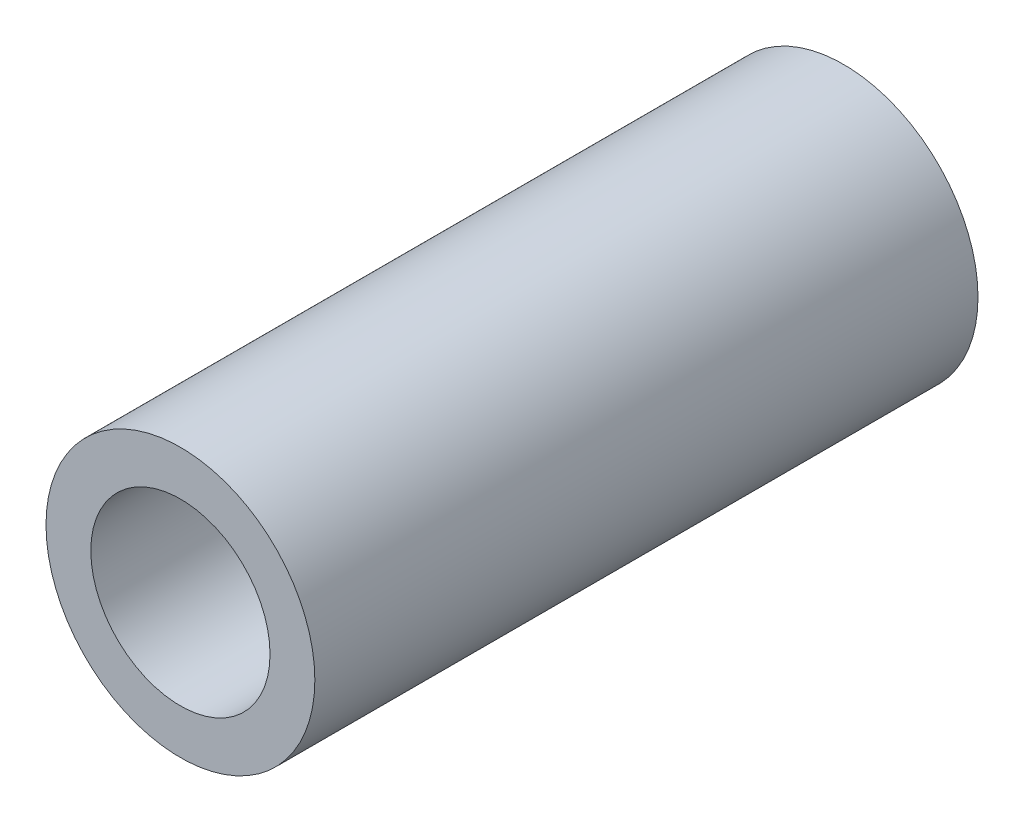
ISO-10303-21;
HEADER;
FILE_DESCRIPTION(('STEP AP214'),'2;1');
FILE_NAME('part.step','',(''),(''),'','','');
FILE_SCHEMA(('AUTOMOTIVE_DESIGN { 1 0 10303 214 1 1 1 1 }'));
ENDSEC;
DATA;
#1=APPLICATION_CONTEXT('core data for automotive mechanical design processes');
#2=APPLICATION_PROTOCOL_DEFINITION('international standard','automotive_design',2000,#1);
#3=PRODUCT_CONTEXT('',#1,'mechanical');
#4=PRODUCT('Part','Part','',(#3));
#5=PRODUCT_RELATED_PRODUCT_CATEGORY('part','',(#4));
#6=PRODUCT_DEFINITION_FORMATION('','',#4);
#7=PRODUCT_DEFINITION_CONTEXT('part definition',#1,'design');
#8=PRODUCT_DEFINITION('design','',#6,#7);
#9=PRODUCT_DEFINITION_SHAPE('','',#8);
#10=(LENGTH_UNIT() NAMED_UNIT(*) SI_UNIT(.MILLI.,.METRE.));
#11=(NAMED_UNIT(*) PLANE_ANGLE_UNIT() SI_UNIT($,.RADIAN.));
#12=(NAMED_UNIT(*) SI_UNIT($,.STERADIAN.) SOLID_ANGLE_UNIT());
#13=UNCERTAINTY_MEASURE_WITH_UNIT(LENGTH_MEASURE(1.E-05),#10,'distance_accuracy_value','');
#14=(GEOMETRIC_REPRESENTATION_CONTEXT(3) GLOBAL_UNCERTAINTY_ASSIGNED_CONTEXT((#13)) GLOBAL_UNIT_ASSIGNED_CONTEXT((#10,
#11,#12)) REPRESENTATION_CONTEXT('',''));
#15=CARTESIAN_POINT('',(0.,0.,0.));
#16=DIRECTION('',(0.,0.,1.));
#17=DIRECTION('',(1.,0.,0.));
#18=AXIS2_PLACEMENT_3D('',#15,#16,#17);
#19=CARTESIAN_POINT('',(0.,0.,14.8));
#20=DIRECTION('',(0.,0.,1.));
#21=DIRECTION('',(1.,0.,0.));
#22=AXIS2_PLACEMENT_3D('',#19,#20,#21);
#23=PLANE('',#22);
#24=CARTESIAN_POINT('',(0.,0.,14.8));
#25=DIRECTION('',(0.,0.,1.));
#26=DIRECTION('',(1.,0.,0.));
#27=AXIS2_PLACEMENT_3D('',#24,#25,#26);
#28=CIRCLE('',#27,3.);
#29=CARTESIAN_POINT('',(3.,0.,14.8));
#30=VERTEX_POINT('',#29);
#31=EDGE_CURVE('E10',#30,#30,#28,.T.);
#32=ORIENTED_EDGE('',*,*,#31,.T.);
#33=EDGE_LOOP('',(#32));
#34=FACE_BOUND('',#33,.T.);
#35=CARTESIAN_POINT('',(0.,0.,14.8));
#36=DIRECTION('',(0.,0.,1.));
#37=DIRECTION('',(1.,0.,0.));
#38=AXIS2_PLACEMENT_3D('',#35,#36,#37);
#39=CIRCLE('',#38,2.);
#40=CARTESIAN_POINT('',(2.,0.,14.8));
#41=VERTEX_POINT('',#40);
#42=EDGE_CURVE('E43',#41,#41,#39,.T.);
#43=ORIENTED_EDGE('',*,*,#42,.F.);
#44=EDGE_LOOP('',(#43));
#45=FACE_BOUND('',#44,.T.);
#46=ADVANCED_FACE('F32',(#34,#45),#23,.T.);
#47=CARTESIAN_POINT('',(0.,0.,0.));
#48=DIRECTION('',(0.,0.,1.));
#49=DIRECTION('',(1.,0.,0.));
#50=AXIS2_PLACEMENT_3D('',#47,#48,#49);
#51=PLANE('',#50);
#52=CARTESIAN_POINT('',(0.,0.,0.));
#53=DIRECTION('',(0.,0.,1.));
#54=DIRECTION('',(1.,0.,0.));
#55=AXIS2_PLACEMENT_3D('',#52,#53,#54);
#56=CIRCLE('',#55,3.);
#57=CARTESIAN_POINT('',(3.,0.,0.));
#58=VERTEX_POINT('',#57);
#59=EDGE_CURVE('E36',#58,#58,#56,.T.);
#60=ORIENTED_EDGE('',*,*,#59,.F.);
#61=EDGE_LOOP('',(#60));
#62=FACE_BOUND('',#61,.T.);
#63=CARTESIAN_POINT('',(0.,0.,0.));
#64=DIRECTION('',(0.,0.,1.));
#65=DIRECTION('',(1.,0.,0.));
#66=AXIS2_PLACEMENT_3D('',#63,#64,#65);
#67=CIRCLE('',#66,2.);
#68=CARTESIAN_POINT('',(2.,0.,0.));
#69=VERTEX_POINT('',#68);
#70=EDGE_CURVE('E45',#69,#69,#67,.T.);
#71=ORIENTED_EDGE('',*,*,#70,.T.);
#72=EDGE_LOOP('',(#71));
#73=FACE_BOUND('',#72,.T.);
#74=ADVANCED_FACE('F55',(#62,#73),#51,.F.);
#75=CARTESIAN_POINT('',(0.,0.,14.8));
#76=DIRECTION('',(0.,0.,-1.));
#77=DIRECTION('',(-1.,0.,0.));
#78=AXIS2_PLACEMENT_3D('',#75,#76,#77);
#79=CYLINDRICAL_SURFACE('',#78,3.);
#80=ORIENTED_EDGE('',*,*,#31,.F.);
#81=EDGE_LOOP('',(#80));
#82=FACE_BOUND('',#81,.T.);
#83=ORIENTED_EDGE('',*,*,#59,.T.);
#84=EDGE_LOOP('',(#83));
#85=FACE_BOUND('',#84,.T.);
#86=ADVANCED_FACE('F34',(#82,#85),#79,.T.);
#87=CARTESIAN_POINT('',(0.,0.,14.8));
#88=DIRECTION('',(0.,0.,-1.));
#89=DIRECTION('',(-1.,0.,0.));
#90=AXIS2_PLACEMENT_3D('',#87,#88,#89);
#91=CYLINDRICAL_SURFACE('',#90,2.);
#92=ORIENTED_EDGE('',*,*,#42,.T.);
#93=EDGE_LOOP('',(#92));
#94=FACE_BOUND('',#93,.T.);
#95=ORIENTED_EDGE('',*,*,#70,.F.);
#96=EDGE_LOOP('',(#95));
#97=FACE_BOUND('',#96,.T.);
#98=ADVANCED_FACE('F51',(#94,#97),#91,.F.);
#99=CLOSED_SHELL('',(#46,#74,#86,#98));
#100=MANIFOLD_SOLID_BREP('B2',#99);
#101=ADVANCED_BREP_SHAPE_REPRESENTATION('',(#18,#100),#14);
#102=SHAPE_DEFINITION_REPRESENTATION(#9,#101);
ENDSEC;
END-ISO-10303-21;
